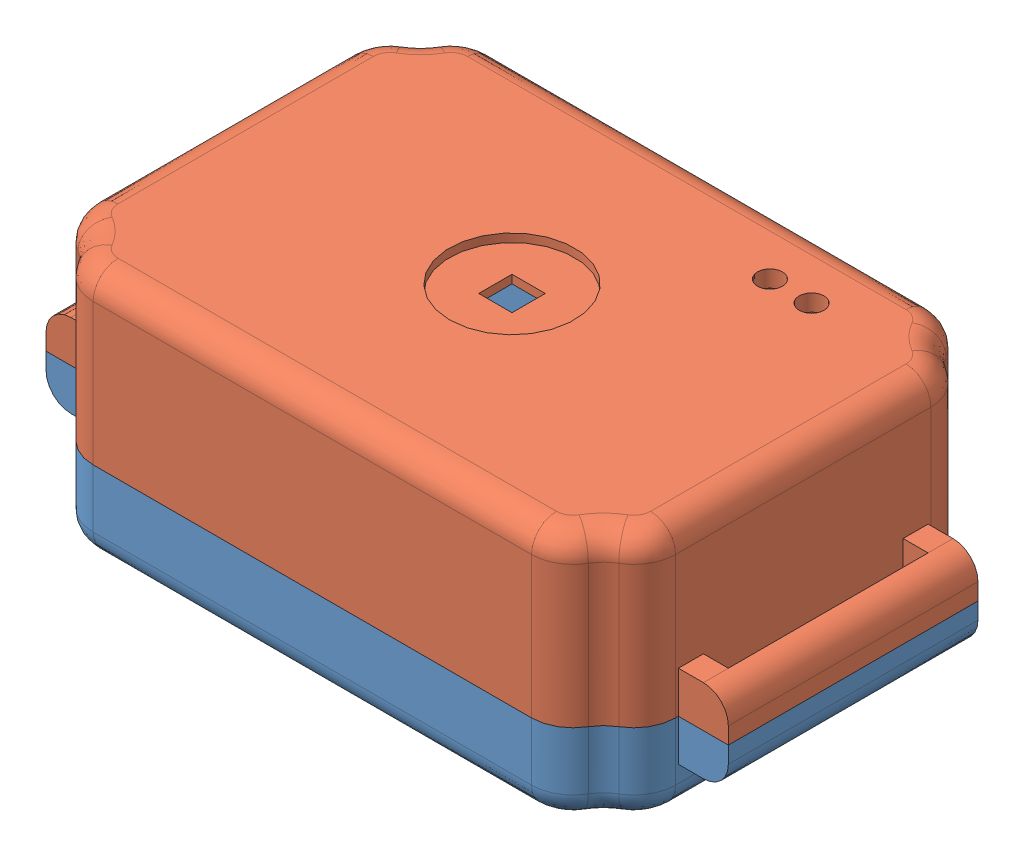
SolidWorks assembly Assem1.SLDASM, configuration Default (file format 14000). Lengths in mm.
Overall size (82 30 48).
3 component instances, 3 part files, 4 mates.
Components (placement in the parent):
- bottom with battery final-1: bottom with battery final.SLDPRT [Default] at (27.4224 37.1444 63.3648) size (82 14 48)
- up lid final -2: up lid final .SLDPRT [Default] at (27.4224 67.1444 63.3648) x (1 0 0) z (0 0 -1) size (82 20 48)
- batteryLid-1: batteryLid.SLDPRT [Default] at (150.1775 37.1444 -6.9209) size (30 4 19.82)
Mates (geometry in assembly coordinates):
- Coincident1: coincident anti-aligned: line of bottom with battery final-1 through (1.0827 47.1444 87.3648) axis (1 0 0); line of up lid final -2 through (53.7622 47.1444 87.3648) axis (-1 0 0)
- Coincident2: coincident anti-aligned: line of bottom with battery final-1 through (68.4224 47.1444 48.3648) axis (0 0 1); line of up lid final -2 through (68.4224 47.1444 78.3648) axis (0 0 -1)
- Coincident3: coincident aligned: line of bottom with battery final-1 through (42.4224 38.1444 42.3648) axis (-1 0 0); line of batteryLid-1 through (42.4224 38.1444 42.3648) axis (-1 0 0)
- Coincident4: coincident aligned: line of bottom with battery final-1 through (42.4224 37.1444 57.8648) axis (0 0 -1); line of batteryLid-1 through (42.4224 37.1444 57.3648) axis (0 0 -1)
